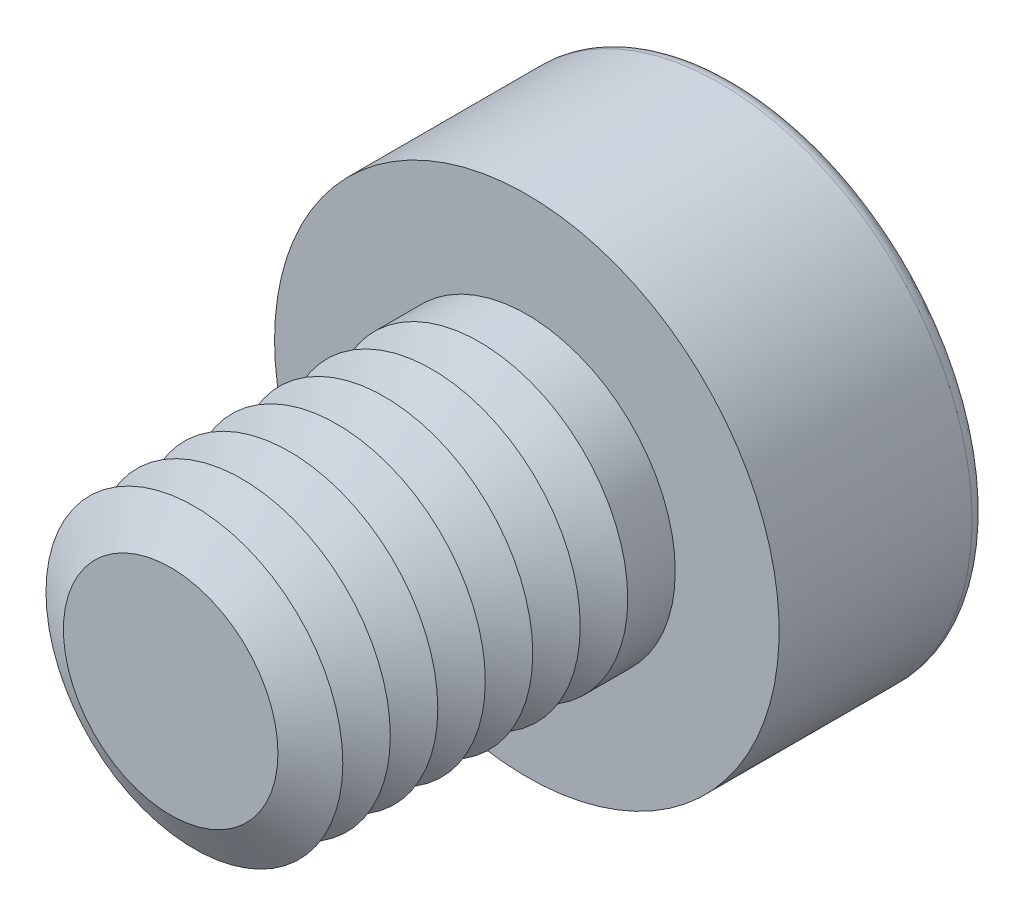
from build123d import *

# Parameters (mm, degrees)
SKETCH1_R           = 2.5
BOSS_EXTRUDE1_DEPTH = 6
SKETCH2_R           = 4.25
BOSS_EXTRUDE2_DEPTH = 3.5
CUT_EXTRUDE1_DEPTH  = 2.25
FILLET1_R           = 0.25
LPATTERN1_COUNT     = 7
LPATTERN1_PITCH     = 0.8


with BuildPart() as part:
    # Sketch1 → Boss-Extrude1 (new body)
    with BuildSketch(Plane.XY):
        Circle(SKETCH1_R)
    extrude(amount=BOSS_EXTRUDE1_DEPTH)

    # Sketch2 → Boss-Extrude2 (add)
    with BuildSketch(Plane(origin=(0, 0, 0), x_dir=(-1, 0, 0), z_dir=(0, 0, -1))):
        Circle(SKETCH2_R)
    extrude(amount=BOSS_EXTRUDE2_DEPTH)

    # Sketch3 → Cut-Extrude1 (cut)
    with BuildSketch(Plane(origin=(0, 0, -3.5), x_dir=(-1, 0, 0), z_dir=(0, 0, -1))):
        Polygon((-0.866025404, 1.5), (-1.732050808, 0), (-0.866025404, -1.5), (0.866025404, -1.5), (1.732050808, 0), (0.866025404, 1.5), align=None)
    extrude(amount=-CUT_EXTRUDE1_DEPTH, mode=Mode.SUBTRACT)

    # Fillet1
    fillet1_edges = [part.edges().sort_by_distance(p)[0] for p in [
        (4.25, 0, -3.5),
    ]]
    fillet(fillet1_edges, radius=FILLET1_R)

    # Cut-Extrude2 cone 1 section (on through the dimple's axis) → Cut-Extrude2 (revolve, cut)
    with BuildSketch(Plane(origin=(0, 0, -1.25), x_dir=(0, 1, 0), z_dir=(1, 0, 0))):
        Polygon((0, 0), (1.5, 0), (0, 0.866025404), align=None)
    revolve(axis=Axis((0, 0, -1.25), (0, 0, 1)), mode=Mode.SUBTRACT)

    # Cut-Extrude3 cone 1 section (on through the dimple's axis) → Cut-Extrude3 (revolve, cut)
    with BuildSketch(Plane(origin=(0, 0, -3.5), x_dir=(0, 1, 0), z_dir=(1, 0, 0))):
        Polygon((0, 0), (1.732050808, 0), (0, 0.464101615), align=None)
    revolve(axis=Axis((0, 0, -3.5), (0, 0, 1)), mode=Mode.SUBTRACT)

    # Sketch7 → Cut-Revolve1 (revolve, cut)
    with BuildSketch(Plane(origin=(0, 0, 0), x_dir=(0, 0, -1), z_dir=(1, 0, 0)), mode=Mode.PRIVATE) as cut_revolve1_sk:
        Polygon((-6, 1.807179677), (-5.6, 2.5), (-6.4, 2.5), align=None)
    cut_revolve1 = revolve(cut_revolve1_sk.sketch.rotate(Axis((0, 0, 6), (0, 0, -1)), 90), axis=Axis((0, 0, 6), (0, 0, -1)), mode=Mode.SUBTRACT)

    # LPattern1: Cut-Revolve1 ×7
    with Locations(*[(0, 0, -i * LPATTERN1_PITCH) for i in range(1, LPATTERN1_COUNT)]):
        add(cut_revolve1, mode=Mode.SUBTRACT)


solid = part.part
